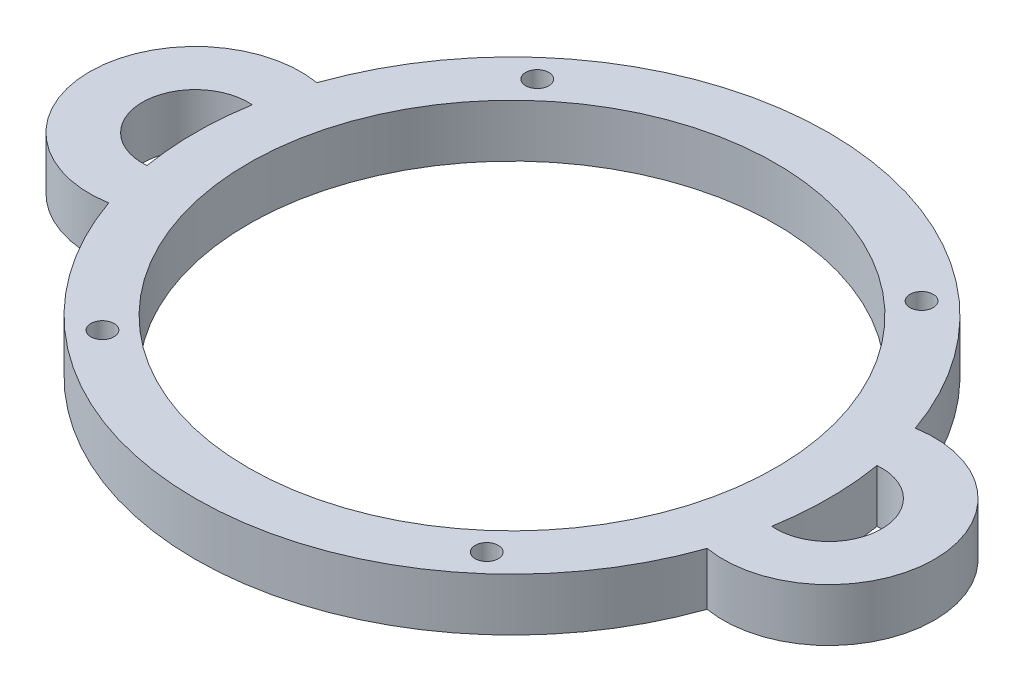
from build123d import *

# Parameters (mm, degrees)
SKETCH1_R           = 50
SKETCH1_R_2         = 2.2
BOSS_EXTRUDE1_DEPTH = 10


with BuildPart() as part:
    # Sketch1 → Boss-Extrude1 (new body)
    with BuildSketch(Plane(origin=(0, 0, 0), x_dir=(1, 0, 0), z_dir=(0, 1, 0))):
        with BuildLine():
            ThreePointArc((56.720431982, 19.738976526), (0, 60.056927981), (-56.720431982, 19.738976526))
            ThreePointArc((-56.720431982, 19.738976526), (-80.075903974, 0), (-56.720431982, -19.738976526))
            ThreePointArc((-56.720431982, -19.738976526), (0, -60.056927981), (56.720431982, -19.738976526))
            ThreePointArc((56.720431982, -19.738976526), (80.075903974, 0), (56.720431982, 19.738976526))
        make_face()
        with Locations(Location((0, 0, 0), (0, 0, 270))):
            Circle(SKETCH1_R, mode=Mode.SUBTRACT)
        with Locations(Location((-36.42965754, 41.218014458, 0), (0, 0, 270))):
            Circle(SKETCH1_R_2, mode=Mode.SUBTRACT)
        with Locations(Location((36.42965754, 41.218014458, 0), (0, 0, 270))):
            Circle(SKETCH1_R_2, mode=Mode.SUBTRACT)
        with Locations(Location((-36.42965754, -41.218014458, 0), (0, 0, 270))):
            Circle(SKETCH1_R_2, mode=Mode.SUBTRACT)
        with Locations(Location((36.42965754, -41.218014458, 0), (0, 0, 270))):
            Circle(SKETCH1_R_2, mode=Mode.SUBTRACT)
        with BuildLine():
            ThreePointArc((-59.222803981, 9.974672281), (-70.066415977, 0), (-59.222803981, -9.974672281))
            ThreePointArc((-59.222803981, -9.974672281), (-60.056927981, 0), (-59.222803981, 9.974672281))
        make_face(mode=Mode.SUBTRACT)
        with BuildLine():
            ThreePointArc((59.222803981, -9.974672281), (70.066415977, 0), (59.222803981, 9.974672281))
            ThreePointArc((59.222803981, 9.974672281), (60.056927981, 0), (59.222803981, -9.974672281))
        make_face(mode=Mode.SUBTRACT)
    extrude(amount=BOSS_EXTRUDE1_DEPTH)


solid = part.part
